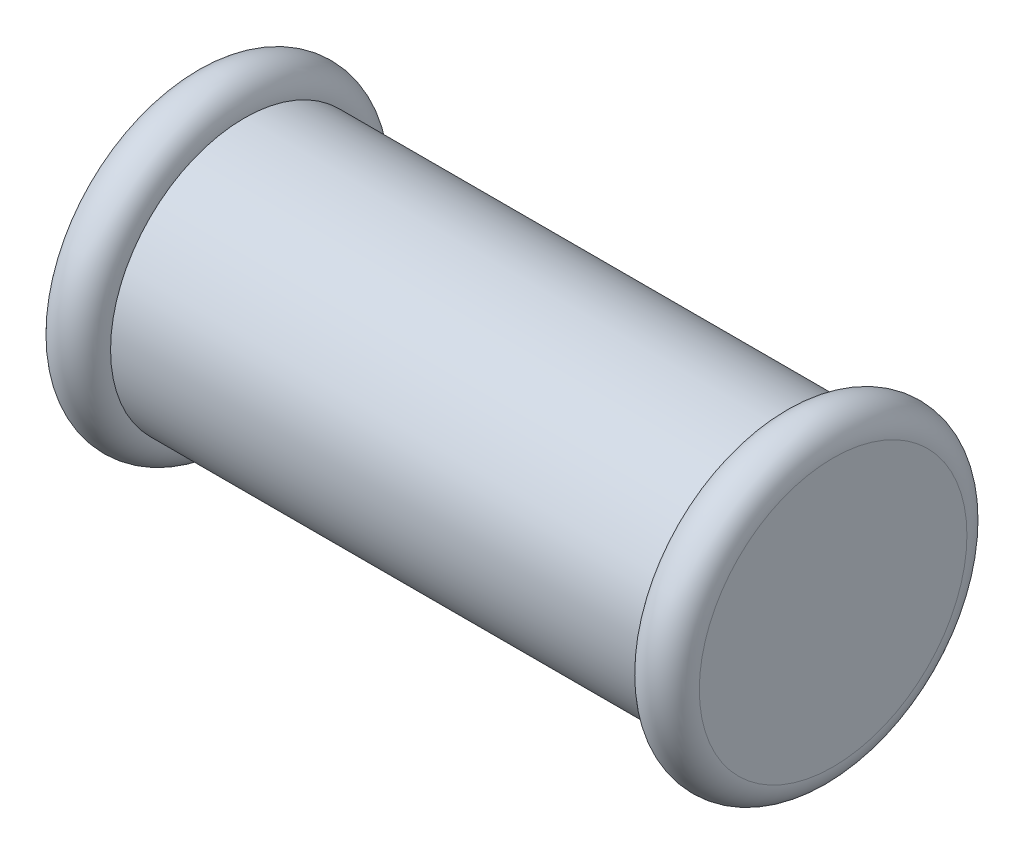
ISO-10303-21;
HEADER;
FILE_DESCRIPTION(('STEP AP214'),'2;1');
FILE_NAME('part.step','',(''),(''),'','','');
FILE_SCHEMA(('AUTOMOTIVE_DESIGN { 1 0 10303 214 1 1 1 1 }'));
ENDSEC;
DATA;
#1=APPLICATION_CONTEXT('core data for automotive mechanical design processes');
#2=APPLICATION_PROTOCOL_DEFINITION('international standard','automotive_design',2000,#1);
#3=PRODUCT_CONTEXT('',#1,'mechanical');
#4=PRODUCT('Part','Part','',(#3));
#5=PRODUCT_RELATED_PRODUCT_CATEGORY('part','',(#4));
#6=PRODUCT_DEFINITION_FORMATION('','',#4);
#7=PRODUCT_DEFINITION_CONTEXT('part definition',#1,'design');
#8=PRODUCT_DEFINITION('design','',#6,#7);
#9=PRODUCT_DEFINITION_SHAPE('','',#8);
#10=(LENGTH_UNIT() NAMED_UNIT(*) SI_UNIT(.MILLI.,.METRE.));
#11=(NAMED_UNIT(*) PLANE_ANGLE_UNIT() SI_UNIT($,.RADIAN.));
#12=(NAMED_UNIT(*) SI_UNIT($,.STERADIAN.) SOLID_ANGLE_UNIT());
#13=UNCERTAINTY_MEASURE_WITH_UNIT(LENGTH_MEASURE(1.E-05),#10,'distance_accuracy_value','');
#14=(GEOMETRIC_REPRESENTATION_CONTEXT(3) GLOBAL_UNCERTAINTY_ASSIGNED_CONTEXT((#13)) GLOBAL_UNIT_ASSIGNED_CONTEXT((#10,
#11,#12)) REPRESENTATION_CONTEXT('',''));
#15=CARTESIAN_POINT('',(0.,0.,0.));
#16=DIRECTION('',(0.,0.,1.));
#17=DIRECTION('',(1.,0.,0.));
#18=AXIS2_PLACEMENT_3D('',#15,#16,#17);
#19=CARTESIAN_POINT('',(2.,0.,0.));
#20=DIRECTION('',(-1.,0.,0.));
#21=DIRECTION('',(0.,0.,1.));
#22=AXIS2_PLACEMENT_3D('',#19,#20,#21);
#23=TOROIDAL_SURFACE('',#22,10.,2.);
#24=CARTESIAN_POINT('',(0.,0.,0.));
#25=DIRECTION('',(-1.,0.,0.));
#26=DIRECTION('',(0.,0.,1.));
#27=AXIS2_PLACEMENT_3D('',#24,#25,#26);
#28=CIRCLE('',#27,10.);
#29=CARTESIAN_POINT('',(0.,0.,10.));
#30=VERTEX_POINT('',#29);
#31=EDGE_CURVE('E12',#30,#30,#28,.T.);
#32=ORIENTED_EDGE('',*,*,#31,.F.);
#33=EDGE_LOOP('',(#32));
#34=FACE_BOUND('',#33,.T.);
#35=CARTESIAN_POINT('',(4.,0.,0.));
#36=DIRECTION('',(-1.,0.,0.));
#37=DIRECTION('',(0.,0.,1.));
#38=AXIS2_PLACEMENT_3D('',#35,#36,#37);
#39=CIRCLE('',#38,10.);
#40=CARTESIAN_POINT('',(4.,0.,10.));
#41=VERTEX_POINT('',#40);
#42=EDGE_CURVE('E54',#41,#41,#39,.T.);
#43=ORIENTED_EDGE('',*,*,#42,.T.);
#44=EDGE_LOOP('',(#43));
#45=FACE_BOUND('',#44,.T.);
#46=ADVANCED_FACE('F40',(#34,#45),#23,.T.);
#47=CARTESIAN_POINT('',(0.,10.,0.));
#48=DIRECTION('',(1.,0.,0.));
#49=DIRECTION('',(0.,0.,-1.));
#50=AXIS2_PLACEMENT_3D('',#47,#48,#49);
#51=PLANE('',#50);
#52=ORIENTED_EDGE('',*,*,#31,.T.);
#53=EDGE_LOOP('',(#52));
#54=FACE_BOUND('',#53,.T.);
#55=ADVANCED_FACE('F74',(#54),#51,.F.);
#56=CARTESIAN_POINT('',(48.,0.,0.));
#57=DIRECTION('',(-1.,0.,0.));
#58=DIRECTION('',(0.,0.,1.));
#59=AXIS2_PLACEMENT_3D('',#56,#57,#58);
#60=PLANE('',#59);
#61=CARTESIAN_POINT('',(48.,0.,0.));
#62=DIRECTION('',(-1.,0.,0.));
#63=DIRECTION('',(0.,0.,1.));
#64=AXIS2_PLACEMENT_3D('',#61,#62,#63);
#65=CIRCLE('',#64,10.);
#66=CARTESIAN_POINT('',(48.,0.,10.));
#67=VERTEX_POINT('',#66);
#68=EDGE_CURVE('E46',#67,#67,#65,.T.);
#69=ORIENTED_EDGE('',*,*,#68,.F.);
#70=EDGE_LOOP('',(#69));
#71=FACE_BOUND('',#70,.T.);
#72=ADVANCED_FACE('F69',(#71),#60,.F.);
#73=CARTESIAN_POINT('',(46.,0.,0.));
#74=DIRECTION('',(-1.,0.,0.));
#75=DIRECTION('',(0.,0.,1.));
#76=AXIS2_PLACEMENT_3D('',#73,#74,#75);
#77=TOROIDAL_SURFACE('',#76,10.,2.);
#78=CARTESIAN_POINT('',(44.,0.,0.));
#79=DIRECTION('',(-1.,0.,0.));
#80=DIRECTION('',(0.,0.,1.));
#81=AXIS2_PLACEMENT_3D('',#78,#79,#80);
#82=CIRCLE('',#81,10.);
#83=CARTESIAN_POINT('',(44.,0.,10.));
#84=VERTEX_POINT('',#83);
#85=EDGE_CURVE('E50',#84,#84,#82,.T.);
#86=ORIENTED_EDGE('',*,*,#85,.F.);
#87=EDGE_LOOP('',(#86));
#88=FACE_BOUND('',#87,.T.);
#89=ORIENTED_EDGE('',*,*,#68,.T.);
#90=EDGE_LOOP('',(#89));
#91=FACE_BOUND('',#90,.T.);
#92=ADVANCED_FACE('F64',(#88,#91),#77,.T.);
#93=CARTESIAN_POINT('',(-31.6037129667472,0.,0.));
#94=DIRECTION('',(-1.,0.,0.));
#95=DIRECTION('',(0.,0.,1.));
#96=AXIS2_PLACEMENT_3D('',#93,#94,#95);
#97=CYLINDRICAL_SURFACE('',#96,10.);
#98=ORIENTED_EDGE('',*,*,#42,.F.);
#99=EDGE_LOOP('',(#98));
#100=FACE_BOUND('',#99,.T.);
#101=ORIENTED_EDGE('',*,*,#85,.T.);
#102=EDGE_LOOP('',(#101));
#103=FACE_BOUND('',#102,.T.);
#104=ADVANCED_FACE('F61',(#100,#103),#97,.T.);
#105=CLOSED_SHELL('',(#46,#55,#72,#92,#104));
#106=MANIFOLD_SOLID_BREP('B2',#105);
#107=ADVANCED_BREP_SHAPE_REPRESENTATION('',(#18,#106),#14);
#108=SHAPE_DEFINITION_REPRESENTATION(#9,#107);
ENDSEC;
END-ISO-10303-21;
